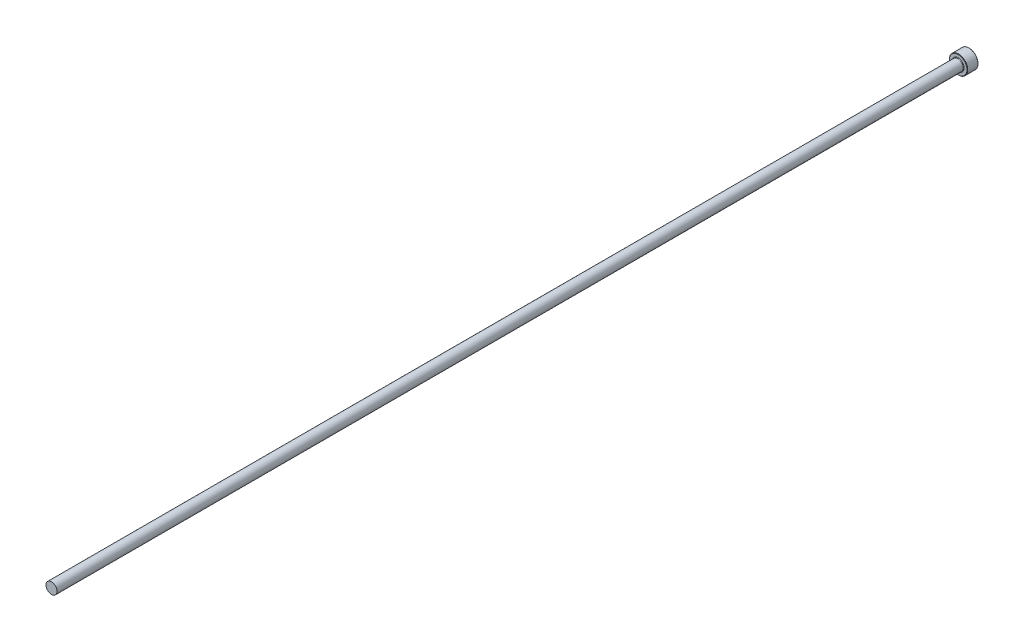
ISO-10303-21;
HEADER;
FILE_DESCRIPTION(('STEP AP214'),'2;1');
FILE_NAME('part.step','',(''),(''),'','','');
FILE_SCHEMA(('AUTOMOTIVE_DESIGN { 1 0 10303 214 1 1 1 1 }'));
ENDSEC;
DATA;
#1=APPLICATION_CONTEXT('core data for automotive mechanical design processes');
#2=APPLICATION_PROTOCOL_DEFINITION('international standard','automotive_design',2000,#1);
#3=PRODUCT_CONTEXT('',#1,'mechanical');
#4=PRODUCT('Part','Part','',(#3));
#5=PRODUCT_RELATED_PRODUCT_CATEGORY('part','',(#4));
#6=PRODUCT_DEFINITION_FORMATION('','',#4);
#7=PRODUCT_DEFINITION_CONTEXT('part definition',#1,'design');
#8=PRODUCT_DEFINITION('design','',#6,#7);
#9=PRODUCT_DEFINITION_SHAPE('','',#8);
#10=(LENGTH_UNIT() NAMED_UNIT(*) SI_UNIT(.MILLI.,.METRE.));
#11=(NAMED_UNIT(*) PLANE_ANGLE_UNIT() SI_UNIT($,.RADIAN.));
#12=(NAMED_UNIT(*) SI_UNIT($,.STERADIAN.) SOLID_ANGLE_UNIT());
#13=UNCERTAINTY_MEASURE_WITH_UNIT(LENGTH_MEASURE(1.E-05),#10,'distance_accuracy_value','');
#14=(GEOMETRIC_REPRESENTATION_CONTEXT(3) GLOBAL_UNCERTAINTY_ASSIGNED_CONTEXT((#13)) GLOBAL_UNIT_ASSIGNED_CONTEXT((#10,
#11,#12)) REPRESENTATION_CONTEXT('',''));
#15=CARTESIAN_POINT('',(0.,0.,0.));
#16=DIRECTION('',(0.,0.,1.));
#17=DIRECTION('',(1.,0.,0.));
#18=AXIS2_PLACEMENT_3D('',#15,#16,#17);
#19=CARTESIAN_POINT('',(0.,2.99999999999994,500.));
#20=DIRECTION('',(0.,0.,-1.));
#21=DIRECTION('',(-1.,0.,0.));
#22=AXIS2_PLACEMENT_3D('',#19,#20,#21);
#23=PLANE('',#22);
#24=CARTESIAN_POINT('',(0.,0.,500.));
#25=DIRECTION('',(0.,0.,1.));
#26=DIRECTION('',(1.,0.,0.));
#27=AXIS2_PLACEMENT_3D('',#24,#25,#26);
#28=CIRCLE('',#27,2.99999999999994);
#29=CARTESIAN_POINT('',(2.99999999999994,0.,500.));
#30=VERTEX_POINT('',#29);
#31=EDGE_CURVE('E50',#30,#30,#28,.T.);
#32=ORIENTED_EDGE('',*,*,#31,.T.);
#33=EDGE_LOOP('',(#32));
#34=FACE_BOUND('',#33,.T.);
#35=ADVANCED_FACE('F30',(#34),#23,.F.);
#36=CARTESIAN_POINT('',(0.,0.,109.050628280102));
#37=DIRECTION('',(0.,0.,1.));
#38=DIRECTION('',(1.,0.,0.));
#39=AXIS2_PLACEMENT_3D('',#36,#37,#38);
#40=CYLINDRICAL_SURFACE('',#39,2.99999999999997);
#41=ORIENTED_EDGE('',*,*,#31,.F.);
#42=EDGE_LOOP('',(#41));
#43=FACE_BOUND('',#42,.T.);
#44=CARTESIAN_POINT('',(0.,0.,6.3));
#45=DIRECTION('',(0.,0.,1.));
#46=DIRECTION('',(1.,0.,0.));
#47=AXIS2_PLACEMENT_3D('',#44,#45,#46);
#48=CIRCLE('',#47,3.);
#49=CARTESIAN_POINT('',(3.,0.,6.3));
#50=VERTEX_POINT('',#49);
#51=EDGE_CURVE('E53',#50,#50,#48,.T.);
#52=ORIENTED_EDGE('',*,*,#51,.T.);
#53=EDGE_LOOP('',(#52));
#54=FACE_BOUND('',#53,.T.);
#55=ADVANCED_FACE('F73',(#43,#54),#40,.T.);
#56=CARTESIAN_POINT('',(0.,0.,6.3));
#57=DIRECTION('',(0.,0.,1.));
#58=DIRECTION('',(1.,0.,0.));
#59=AXIS2_PLACEMENT_3D('',#56,#57,#58);
#60=TOROIDAL_SURFACE('',#59,3.3,0.3);
#61=ORIENTED_EDGE('',*,*,#51,.F.);
#62=EDGE_LOOP('',(#61));
#63=FACE_BOUND('',#62,.T.);
#64=CARTESIAN_POINT('',(0.,0.,6.00000000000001));
#65=DIRECTION('',(0.,0.,1.));
#66=DIRECTION('',(1.,0.,0.));
#67=AXIS2_PLACEMENT_3D('',#64,#65,#66);
#68=CIRCLE('',#67,3.3);
#69=CARTESIAN_POINT('',(3.3,0.,6.00000000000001));
#70=VERTEX_POINT('',#69);
#71=EDGE_CURVE('E56',#70,#70,#68,.T.);
#72=ORIENTED_EDGE('',*,*,#71,.T.);
#73=EDGE_LOOP('',(#72));
#74=FACE_BOUND('',#73,.T.);
#75=ADVANCED_FACE('F60',(#63,#74),#60,.F.);
#76=CARTESIAN_POINT('',(0.,5.,6.));
#77=DIRECTION('',(0.,0.,-1.));
#78=DIRECTION('',(-1.,0.,0.));
#79=AXIS2_PLACEMENT_3D('',#76,#77,#78);
#80=PLANE('',#79);
#81=CARTESIAN_POINT('',(0.,0.,6.));
#82=DIRECTION('',(0.,0.,-1.));
#83=DIRECTION('',(-1.,0.,0.));
#84=AXIS2_PLACEMENT_3D('',#81,#82,#83);
#85=CIRCLE('',#84,4.79999999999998);
#86=CARTESIAN_POINT('',(-4.79999999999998,0.,6.));
#87=VERTEX_POINT('',#86);
#88=EDGE_CURVE('E10',#87,#87,#85,.F.);
#89=ORIENTED_EDGE('',*,*,#88,.T.);
#90=EDGE_LOOP('',(#89));
#91=FACE_BOUND('',#90,.T.);
#92=ORIENTED_EDGE('',*,*,#71,.F.);
#93=EDGE_LOOP('',(#92));
#94=FACE_BOUND('',#93,.T.);
#95=ADVANCED_FACE('F62',(#91,#94),#80,.F.);
#96=CARTESIAN_POINT('',(0.,0.,109.050628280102));
#97=DIRECTION('',(0.,0.,1.));
#98=DIRECTION('',(1.,0.,0.));
#99=AXIS2_PLACEMENT_3D('',#96,#97,#98);
#100=CYLINDRICAL_SURFACE('',#99,5.);
#101=CARTESIAN_POINT('',(0.,0.,0.19999999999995));
#102=DIRECTION('',(0.,0.,1.));
#103=DIRECTION('',(1.,0.,0.));
#104=AXIS2_PLACEMENT_3D('',#101,#102,#103);
#105=CIRCLE('',#104,5.);
#106=CARTESIAN_POINT('',(5.,0.,0.19999999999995));
#107=VERTEX_POINT('',#106);
#108=EDGE_CURVE('E41',#107,#107,#105,.T.);
#109=ORIENTED_EDGE('',*,*,#108,.T.);
#110=EDGE_LOOP('',(#109));
#111=FACE_BOUND('',#110,.T.);
#112=CARTESIAN_POINT('',(0.,0.,5.79999999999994));
#113=DIRECTION('',(0.,0.,-1.));
#114=DIRECTION('',(-1.,0.,0.));
#115=AXIS2_PLACEMENT_3D('',#112,#113,#114);
#116=CIRCLE('',#115,5.);
#117=CARTESIAN_POINT('',(-5.,0.,5.79999999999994));
#118=VERTEX_POINT('',#117);
#119=EDGE_CURVE('E45',#118,#118,#116,.T.);
#120=ORIENTED_EDGE('',*,*,#119,.T.);
#121=EDGE_LOOP('',(#120));
#122=FACE_BOUND('',#121,.T.);
#123=ADVANCED_FACE('F64',(#111,#122),#100,.T.);
#124=CARTESIAN_POINT('',(0.,0.,0.));
#125=DIRECTION('',(0.,0.,1.));
#126=DIRECTION('',(1.,0.,0.));
#127=AXIS2_PLACEMENT_3D('',#124,#125,#126);
#128=PLANE('',#127);
#129=CARTESIAN_POINT('',(0.,0.,0.));
#130=DIRECTION('',(0.,0.,1.));
#131=DIRECTION('',(1.,0.,0.));
#132=AXIS2_PLACEMENT_3D('',#129,#130,#131);
#133=CIRCLE('',#132,4.80000000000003);
#134=CARTESIAN_POINT('',(4.80000000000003,0.,0.));
#135=VERTEX_POINT('',#134);
#136=EDGE_CURVE('E37',#135,#135,#133,.F.);
#137=ORIENTED_EDGE('',*,*,#136,.T.);
#138=EDGE_LOOP('',(#137));
#139=FACE_BOUND('',#138,.T.);
#140=ADVANCED_FACE('F70',(#139),#128,.F.);
#141=CARTESIAN_POINT('',(0.,0.,0.19999999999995));
#142=DIRECTION('',(0.,0.,1.));
#143=DIRECTION('',(1.,0.,0.));
#144=AXIS2_PLACEMENT_3D('',#141,#142,#143);
#145=CONICAL_SURFACE('',#144,5.,0.785398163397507);
#146=CARTESIAN_POINT('',(4.80000000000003,0.,0.));
#147=CARTESIAN_POINT('',(4.80208333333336,0.,0.00208333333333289));
#148=CARTESIAN_POINT('',(4.80416666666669,0.,0.00416666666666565));
#149=CARTESIAN_POINT('',(4.80833333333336,0.,0.00833333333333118));
#150=CARTESIAN_POINT('',(4.81041666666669,0.,0.0104166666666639));
#151=CARTESIAN_POINT('',(4.81458333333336,0.,0.0145833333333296));
#152=CARTESIAN_POINT('',(4.81666666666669,0.,0.0166666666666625));
#153=CARTESIAN_POINT('',(4.82083333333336,0.,0.0208333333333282));
#154=CARTESIAN_POINT('',(4.82291666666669,0.,0.022916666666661));
#155=CARTESIAN_POINT('',(4.82708333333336,0.,0.0270833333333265));
#156=CARTESIAN_POINT('',(4.82916666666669,0.,0.0291666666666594));
#157=CARTESIAN_POINT('',(4.83333333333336,0.,0.033333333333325));
#158=CARTESIAN_POINT('',(4.83541666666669,0.,0.0354166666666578));
#159=CARTESIAN_POINT('',(4.83958333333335,0.,0.0395833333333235));
#160=CARTESIAN_POINT('',(4.84166666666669,0.,0.0416666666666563));
#161=CARTESIAN_POINT('',(4.84583333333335,0.,0.0458333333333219));
#162=CARTESIAN_POINT('',(4.84791666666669,0.,0.0479166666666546));
#163=CARTESIAN_POINT('',(4.85208333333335,0.,0.0520833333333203));
#164=CARTESIAN_POINT('',(4.85416666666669,0.,0.0541666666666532));
#165=CARTESIAN_POINT('',(4.85833333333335,0.,0.0583333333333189));
#166=CARTESIAN_POINT('',(4.86041666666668,0.,0.0604166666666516));
#167=CARTESIAN_POINT('',(4.86458333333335,0.,0.0645833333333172));
#168=CARTESIAN_POINT('',(4.86666666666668,0.,0.06666666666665));
#169=CARTESIAN_POINT('',(4.87083333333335,0.,0.0708333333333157));
#170=CARTESIAN_POINT('',(4.87291666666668,0.,0.0729166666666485));
#171=CARTESIAN_POINT('',(4.87708333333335,0.,0.0770833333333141));
#172=CARTESIAN_POINT('',(4.87916666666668,0.,0.0791666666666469));
#173=CARTESIAN_POINT('',(4.88333333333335,0.,0.0833333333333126));
#174=CARTESIAN_POINT('',(4.88541666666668,0.,0.0854166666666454));
#175=CARTESIAN_POINT('',(4.88958333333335,0.,0.089583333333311));
#176=CARTESIAN_POINT('',(4.89166666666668,0.,0.0916666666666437));
#177=CARTESIAN_POINT('',(4.89583333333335,0.,0.0958333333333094));
#178=CARTESIAN_POINT('',(4.89791666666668,0.,0.0979166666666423));
#179=CARTESIAN_POINT('',(4.90208333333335,0.,0.102083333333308));
#180=CARTESIAN_POINT('',(4.90416666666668,0.,0.104166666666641));
#181=CARTESIAN_POINT('',(4.90833333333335,0.,0.108333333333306));
#182=CARTESIAN_POINT('',(4.91041666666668,0.,0.110416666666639));
#183=CARTESIAN_POINT('',(4.91458333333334,0.,0.114583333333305));
#184=CARTESIAN_POINT('',(4.91666666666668,0.,0.116666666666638));
#185=CARTESIAN_POINT('',(4.92083333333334,0.,0.120833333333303));
#186=CARTESIAN_POINT('',(4.92291666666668,0.,0.122916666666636));
#187=CARTESIAN_POINT('',(4.92708333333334,0.,0.127083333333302));
#188=CARTESIAN_POINT('',(4.92916666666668,0.,0.129166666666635));
#189=CARTESIAN_POINT('',(4.93333333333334,0.,0.1333333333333));
#190=CARTESIAN_POINT('',(4.93541666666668,0.,0.135416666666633));
#191=CARTESIAN_POINT('',(4.93958333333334,0.,0.139583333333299));
#192=CARTESIAN_POINT('',(4.94166666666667,0.,0.141666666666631));
#193=CARTESIAN_POINT('',(4.94583333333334,0.,0.145833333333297));
#194=CARTESIAN_POINT('',(4.94791666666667,0.,0.14791666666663));
#195=CARTESIAN_POINT('',(4.95208333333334,0.,0.152083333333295));
#196=CARTESIAN_POINT('',(4.95416666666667,0.,0.154166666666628));
#197=CARTESIAN_POINT('',(4.95833333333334,0.,0.158333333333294));
#198=CARTESIAN_POINT('',(4.96041666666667,0.,0.160416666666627));
#199=CARTESIAN_POINT('',(4.96458333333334,0.,0.164583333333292));
#200=CARTESIAN_POINT('',(4.96666666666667,0.,0.166666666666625));
#201=CARTESIAN_POINT('',(4.97083333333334,0.,0.170833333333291));
#202=CARTESIAN_POINT('',(4.97291666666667,0.,0.172916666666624));
#203=CARTESIAN_POINT('',(4.97708333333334,0.,0.177083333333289));
#204=CARTESIAN_POINT('',(4.97916666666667,0.,0.179166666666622));
#205=CARTESIAN_POINT('',(4.98333333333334,0.,0.183333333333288));
#206=CARTESIAN_POINT('',(4.98541666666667,0.,0.185416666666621));
#207=CARTESIAN_POINT('',(4.98958333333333,0.,0.189583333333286));
#208=CARTESIAN_POINT('',(4.99166666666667,0.,0.191666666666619));
#209=CARTESIAN_POINT('',(4.99583333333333,0.,0.195833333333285));
#210=CARTESIAN_POINT('',(4.99791666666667,0.,0.197916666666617));
#211=CARTESIAN_POINT('',(5.,0.,0.19999999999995));
#212=B_SPLINE_CURVE_WITH_KNOTS('',3,(#146,#147,#148,#149,#150,#151,#152,#153,#154,#155,#156,
#157,#158,#159,#160,#161,#162,#163,#164,#165,#166,#167,#168,#169,#170,#171,#172,#173,#174,#175,
#176,#177,#178,#179,#180,#181,#182,#183,#184,#185,#186,#187,#188,#189,#190,#191,#192,#193,#194,
#195,#196,#197,#198,#199,#200,#201,#202,#203,#204,#205,#206,#207,#208,#209,#210,#211),
.UNSPECIFIED.,.F.,.F.,(4,2,2,2,2,2,2,2,2,2,2,2,2,2,2,2,2,2,2,2,2,2,2,2,2,2,2,2,2,2,2,2,4),(0.,
0.00883883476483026,0.0176776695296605,0.0265165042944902,0.0353553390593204,0.0441941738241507,
0.0530330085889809,0.0618718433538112,0.0707106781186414,0.0795495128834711,0.0883883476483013,
0.0972271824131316,0.106066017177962,0.114904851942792,0.123743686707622,0.132582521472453,
0.141421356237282,0.150260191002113,0.159099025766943,0.167937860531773,0.176776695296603,
0.185615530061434,0.194454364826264,0.203293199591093,0.212132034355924,0.220970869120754,
0.229809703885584,0.238648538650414,0.247487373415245,0.256326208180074,0.265165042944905,
0.274003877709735,0.282842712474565),.UNSPECIFIED.);
#213=EDGE_CURVE('BSEAM84',#135,#107,#212,.T.);
#214=ORIENTED_EDGE('',*,*,#136,.F.);
#215=ORIENTED_EDGE('',*,*,#108,.F.);
#216=ORIENTED_EDGE('',*,*,#213,.T.);
#217=ORIENTED_EDGE('',*,*,#213,.F.);
#218=EDGE_LOOP('',(#214,#216,#215,#217));
#219=FACE_BOUND('',#218,.T.);
#220=ADVANCED_FACE('F84',(#219),#145,.T.);
#221=CARTESIAN_POINT('',(0.,0.,6.00000000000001));
#222=DIRECTION('',(0.,0.,-1.));
#223=DIRECTION('',(-1.,0.,0.));
#224=AXIS2_PLACEMENT_3D('',#221,#222,#223);
#225=CONICAL_SURFACE('',#224,4.79999999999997,0.785398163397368);
#226=ORIENTED_EDGE('',*,*,#119,.F.);
#227=EDGE_LOOP('',(#226));
#228=FACE_BOUND('',#227,.T.);
#229=ORIENTED_EDGE('',*,*,#88,.F.);
#230=EDGE_LOOP('',(#229));
#231=FACE_BOUND('',#230,.T.);
#232=ADVANCED_FACE('F32',(#228,#231),#225,.T.);
#233=CLOSED_SHELL('',(#35,#55,#75,#95,#123,#140,#220,#232));
#234=MANIFOLD_SOLID_BREP('B2',#233);
#235=ADVANCED_BREP_SHAPE_REPRESENTATION('',(#18,#234),#14);
#236=SHAPE_DEFINITION_REPRESENTATION(#9,#235);
ENDSEC;
END-ISO-10303-21;
